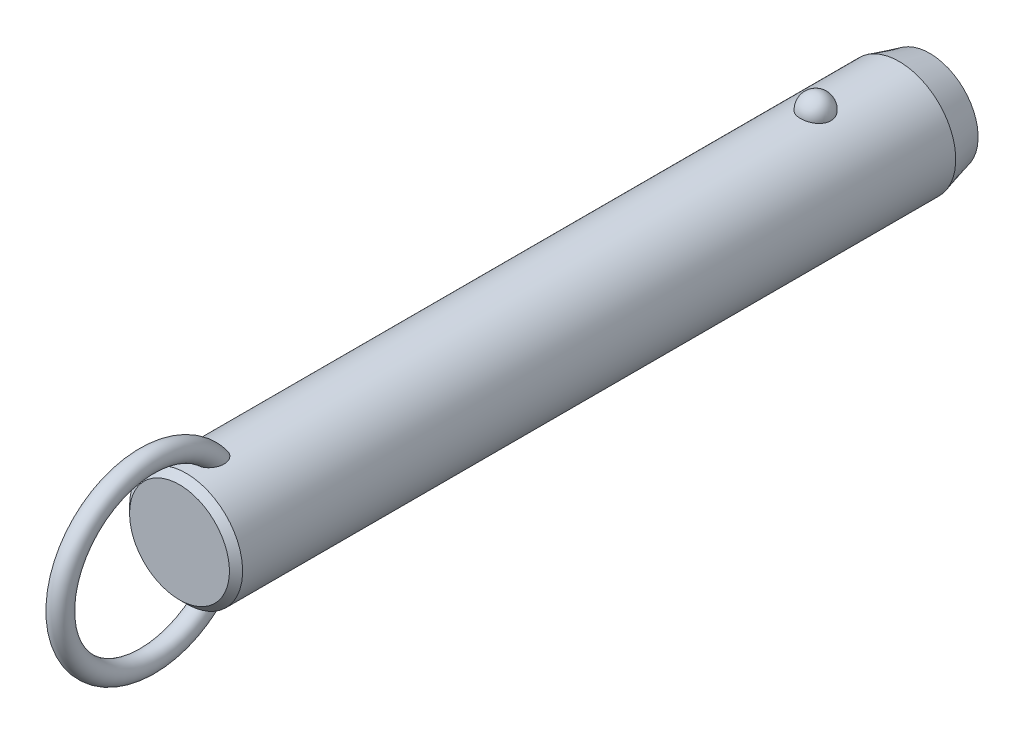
ISO-10303-21;
HEADER;
FILE_DESCRIPTION(('STEP AP214'),'2;1');
FILE_NAME('part.step','',(''),(''),'','','');
FILE_SCHEMA(('AUTOMOTIVE_DESIGN { 1 0 10303 214 1 1 1 1 }'));
ENDSEC;
DATA;
#1=APPLICATION_CONTEXT('core data for automotive mechanical design processes');
#2=APPLICATION_PROTOCOL_DEFINITION('international standard','automotive_design',2000,#1);
#3=PRODUCT_CONTEXT('',#1,'mechanical');
#4=PRODUCT('Part','Part','',(#3));
#5=PRODUCT_RELATED_PRODUCT_CATEGORY('part','',(#4));
#6=PRODUCT_DEFINITION_FORMATION('','',#4);
#7=PRODUCT_DEFINITION_CONTEXT('part definition',#1,'design');
#8=PRODUCT_DEFINITION('design','',#6,#7);
#9=PRODUCT_DEFINITION_SHAPE('','',#8);
#10=(LENGTH_UNIT() NAMED_UNIT(*) SI_UNIT(.MILLI.,.METRE.));
#11=(NAMED_UNIT(*) PLANE_ANGLE_UNIT() SI_UNIT($,.RADIAN.));
#12=(NAMED_UNIT(*) SI_UNIT($,.STERADIAN.) SOLID_ANGLE_UNIT());
#13=UNCERTAINTY_MEASURE_WITH_UNIT(LENGTH_MEASURE(1.E-05),#10,'distance_accuracy_value','');
#14=(GEOMETRIC_REPRESENTATION_CONTEXT(3) GLOBAL_UNCERTAINTY_ASSIGNED_CONTEXT((#13)) GLOBAL_UNIT_ASSIGNED_CONTEXT((#10,
#11,#12)) REPRESENTATION_CONTEXT('',''));
#15=CARTESIAN_POINT('',(0.,0.,0.));
#16=DIRECTION('',(0.,0.,1.));
#17=DIRECTION('',(1.,0.,0.));
#18=AXIS2_PLACEMENT_3D('',#15,#16,#17);
#19=CARTESIAN_POINT('',(0.,0.,109.2));
#20=DIRECTION('',(0.,0.,-1.));
#21=DIRECTION('',(-1.,0.,0.));
#22=AXIS2_PLACEMENT_3D('',#19,#20,#21);
#23=CYLINDRICAL_SURFACE('',#22,11.1);
#24=CARTESIAN_POINT('',(2.9724815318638,10.6945945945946,-3.));
#25=CARTESIAN_POINT('',(2.97247830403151,10.6945972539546,-2.83225059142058));
#26=CARTESIAN_POINT('',(2.95876598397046,10.6984356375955,-2.66445972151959));
#27=CARTESIAN_POINT('',(2.90424529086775,10.7133624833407,-2.33362381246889));
#28=CARTESIAN_POINT('',(2.8634252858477,10.7244540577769,-2.1705808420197));
#29=CARTESIAN_POINT('',(2.75573657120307,10.7526272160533,-1.85396767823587));
#30=CARTESIAN_POINT('',(2.68887937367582,10.7697061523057,-1.70039333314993));
#31=CARTESIAN_POINT('',(2.53079696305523,10.8079438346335,-1.40691598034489));
#32=CARTESIAN_POINT('',(2.43957264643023,10.8291024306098,-1.2670124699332));
#33=CARTESIAN_POINT('',(2.23458150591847,10.8732541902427,-1.00409565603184));
#34=CARTESIAN_POINT('',(2.12071295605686,10.8962553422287,-0.881162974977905));
#35=CARTESIAN_POINT('',(1.87365402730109,10.9414421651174,-0.656352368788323));
#36=CARTESIAN_POINT('',(1.74046358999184,10.9636278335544,-0.554474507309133));
#37=CARTESIAN_POINT('',(1.45872188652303,11.0046495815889,-0.374872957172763));
#38=CARTESIAN_POINT('',(1.31021276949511,11.0234944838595,-0.297085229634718));
#39=CARTESIAN_POINT('',(1.00170030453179,11.0557957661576,-0.167529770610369));
#40=CARTESIAN_POINT('',(0.841698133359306,11.0692526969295,-0.115759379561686));
#41=CARTESIAN_POINT('',(0.517607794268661,11.0890932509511,-0.0403925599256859));
#42=CARTESIAN_POINT('',(0.353633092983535,11.0955916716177,-0.0163383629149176));
#43=CARTESIAN_POINT('',(0.0238420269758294,11.1011989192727,0.0044517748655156));
#44=CARTESIAN_POINT('',(-0.141974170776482,11.1003084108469,0.00119017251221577));
#45=CARTESIAN_POINT('',(-0.468405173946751,11.0912990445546,-0.0323233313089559));
#46=CARTESIAN_POINT('',(-0.629059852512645,11.0832767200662,-0.0622147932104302));
#47=CARTESIAN_POINT('',(-0.942937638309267,11.0609962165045,-0.147645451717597));
#48=CARTESIAN_POINT('',(-1.09616062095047,11.0467379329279,-0.203185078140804));
#49=CARTESIAN_POINT('',(-1.39181061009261,11.0134071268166,-0.3387529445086));
#50=CARTESIAN_POINT('',(-1.53417383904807,10.9943086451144,-0.418913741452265));
#51=CARTESIAN_POINT('',(-1.80342160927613,10.9533667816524,-0.60144882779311));
#52=CARTESIAN_POINT('',(-1.9303046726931,10.9315231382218,-0.703825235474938));
#53=CARTESIAN_POINT('',(-2.16747598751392,10.887005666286,-0.930091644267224));
#54=CARTESIAN_POINT('',(-2.27742774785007,10.8643239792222,-1.05433291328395));
#55=CARTESIAN_POINT('',(-2.47517316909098,10.8209886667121,-1.31966633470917));
#56=CARTESIAN_POINT('',(-2.56296538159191,10.8003351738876,-1.46075958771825));
#57=CARTESIAN_POINT('',(-2.71500300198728,10.7631304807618,-1.75753646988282));
#58=CARTESIAN_POINT('',(-2.77898901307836,10.7466250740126,-1.91335887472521));
#59=CARTESIAN_POINT('',(-2.88046189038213,10.7198747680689,-2.2339152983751));
#60=CARTESIAN_POINT('',(-2.91794947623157,10.709629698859,-2.39864907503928));
#61=CARTESIAN_POINT('',(-2.96537819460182,10.6965949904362,-2.73165170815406));
#62=CARTESIAN_POINT('',(-2.97542891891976,10.693775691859,-2.89990378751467));
#63=CARTESIAN_POINT('',(-2.96804271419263,10.6958279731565,-3.235752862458));
#64=CARTESIAN_POINT('',(-2.95060646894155,10.7006993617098,-3.40334987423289));
#65=CARTESIAN_POINT('',(-2.88883358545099,10.71753912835,-3.73233906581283));
#66=CARTESIAN_POINT('',(-2.84462026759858,10.7294749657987,-3.89375610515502));
#67=CARTESIAN_POINT('',(-2.73050447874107,10.7590797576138,-4.20667949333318));
#68=CARTESIAN_POINT('',(-2.66060103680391,10.7767489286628,-4.35818546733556));
#69=CARTESIAN_POINT('',(-2.49642559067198,10.8159599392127,-4.6478542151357));
#70=CARTESIAN_POINT('',(-2.40203047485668,10.8375211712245,-4.78594458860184));
#71=CARTESIAN_POINT('',(-2.19143488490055,10.8820570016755,-5.0441038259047));
#72=CARTESIAN_POINT('',(-2.07523364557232,10.9050316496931,-5.16417205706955));
#73=CARTESIAN_POINT('',(-1.82361254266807,10.9499219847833,-5.38334833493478));
#74=CARTESIAN_POINT('',(-1.68812945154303,10.9718338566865,-5.48238464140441));
#75=CARTESIAN_POINT('',(-1.40191298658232,11.0120611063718,-5.65618873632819));
#76=CARTESIAN_POINT('',(-1.25118062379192,11.0303767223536,-5.73095813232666));
#77=CARTESIAN_POINT('',(-0.940570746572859,11.0611653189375,-5.85334725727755));
#78=CARTESIAN_POINT('',(-0.780821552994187,11.0737044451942,-5.90127578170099));
#79=CARTESIAN_POINT('',(-0.455204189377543,11.0918598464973,-5.96992976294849));
#80=CARTESIAN_POINT('',(-0.289336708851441,11.0974768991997,-5.99065827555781));
#81=CARTESIAN_POINT('',(0.0406846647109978,11.1011307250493,-6.00418773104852));
#82=CARTESIAN_POINT('',(0.204817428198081,11.099299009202,-5.99747318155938));
#83=CARTESIAN_POINT('',(0.5295530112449,11.088551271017,-5.9574031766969));
#84=CARTESIAN_POINT('',(0.69015594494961,11.0796354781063,-5.92404858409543));
#85=CARTESIAN_POINT('',(1.0027760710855,11.0557204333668,-5.83180084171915));
#86=CARTESIAN_POINT('',(1.15482001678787,11.0407414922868,-5.77299291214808));
#87=CARTESIAN_POINT('',(1.44678373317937,11.0062913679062,-5.63147366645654));
#88=CARTESIAN_POINT('',(1.58670279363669,10.9868199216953,-5.54876095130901));
#89=CARTESIAN_POINT('',(1.8527023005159,10.9451315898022,-5.36027644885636));
#90=CARTESIAN_POINT('',(1.97855158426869,10.9228788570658,-5.25418644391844));
#91=CARTESIAN_POINT('',(2.21080872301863,10.8782509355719,-5.02251354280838));
#92=CARTESIAN_POINT('',(2.31721312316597,10.8558757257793,-4.89692718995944));
#93=CARTESIAN_POINT('',(2.5094551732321,10.8130715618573,-4.62745408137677));
#94=CARTESIAN_POINT('',(2.59493284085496,10.7926798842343,-4.48330448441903));
#95=CARTESIAN_POINT('',(2.740862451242,10.7565495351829,-4.18236358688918));
#96=CARTESIAN_POINT('',(2.80132490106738,10.7408089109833,-4.02557762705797));
#97=CARTESIAN_POINT('',(2.88959070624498,10.7173718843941,-3.72475308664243));
#98=CARTESIAN_POINT('',(2.92062102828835,10.7088950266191,-3.58171216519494));
#99=CARTESIAN_POINT('',(2.96206765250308,10.6975052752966,-3.29245795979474));
#100=CARTESIAN_POINT('',(2.97248434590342,10.6945922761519,-3.14624473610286));
#101=CARTESIAN_POINT('',(2.9724815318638,10.6945945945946,-3.));
#102=B_SPLINE_CURVE_WITH_KNOTS('',3,(#24,#25,#26,#27,#28,#29,#30,#31,#32,#33,#34,#35,#36,#37,
#38,#39,#40,#41,#42,#43,#44,#45,#46,#47,#48,#49,#50,#51,#52,#53,#54,#55,#56,#57,#58,#59,#60,#61,
#62,#63,#64,#65,#66,#67,#68,#69,#70,#71,#72,#73,#74,#75,#76,#77,#78,#79,#80,#81,#82,#83,#84,#85,
#86,#87,#88,#89,#90,#91,#92,#93,#94,#95,#96,#97,#98,#99,#100,#101),.UNSPECIFIED.,.T.,.F.,(4,2,2,
2,2,2,2,2,2,2,2,2,2,2,2,2,2,2,2,2,2,2,2,2,2,2,2,2,2,2,2,2,2,2,2,2,2,2,4),(0.,0.502722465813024,
1.00566079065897,1.5083769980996,2.01107471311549,2.51608392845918,3.02109467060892,
3.52475118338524,4.02835620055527,4.523518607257,5.0186364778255,5.50715297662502,
5.9956776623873,6.48688002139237,6.97812923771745,7.47814366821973,7.9781907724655,
8.48353712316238,8.9888697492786,9.49218093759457,9.99547960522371,10.4964777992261,
10.997494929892,11.5010810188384,12.0046847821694,12.5099796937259,13.0152411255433,
13.5145635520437,14.0138298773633,14.5043200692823,14.9947943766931,15.4836390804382,
15.9725123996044,16.4685040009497,16.9645836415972,17.4686765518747,17.972557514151,
18.410841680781,18.849117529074),.UNSPECIFIED.);
#103=CARTESIAN_POINT('',(2.9724815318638,10.6945945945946,-3.));
#104=VERTEX_POINT('',#103);
#105=EDGE_CURVE('E41',#104,#104,#102,.T.);
#106=ORIENTED_EDGE('',*,*,#105,.T.);
#107=EDGE_LOOP('',(#106));
#108=FACE_BOUND('',#107,.T.);
#109=CARTESIAN_POINT('',(0.,0.,120.6));
#110=DIRECTION('',(0.,0.,1.));
#111=DIRECTION('',(1.,0.,0.));
#112=AXIS2_PLACEMENT_3D('',#109,#110,#111);
#113=CIRCLE('',#112,11.1);
#114=CARTESIAN_POINT('',(-11.1,0.,120.6));
#115=VERTEX_POINT('',#114);
#116=EDGE_CURVE('E10',#115,#115,#113,.F.);
#117=ORIENTED_EDGE('',*,*,#116,.T.);
#118=EDGE_LOOP('',(#117));
#119=FACE_BOUND('',#118,.T.);
#120=CARTESIAN_POINT('',(-0.564520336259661,-11.0856356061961,112.857815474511));
#121=CARTESIAN_POINT('',(-0.667202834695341,-11.0804062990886,112.891283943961));
#122=CARTESIAN_POINT('',(-0.766875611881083,-11.0738877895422,112.933835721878));
#123=CARTESIAN_POINT('',(-0.957284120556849,-11.0590576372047,113.035419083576));
#124=CARTESIAN_POINT('',(-1.04801616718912,-11.0507452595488,113.09445742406));
#125=CARTESIAN_POINT('',(-1.21800952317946,-11.0333016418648,113.226529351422));
#126=CARTESIAN_POINT('',(-1.29730805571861,-11.0241732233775,113.299515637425));
#127=CARTESIAN_POINT('',(-1.44337665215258,-11.0060026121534,113.457037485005));
#128=CARTESIAN_POINT('',(-1.51014622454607,-10.9969604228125,113.541573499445));
#129=CARTESIAN_POINT('',(-1.63454620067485,-10.9791841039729,113.725521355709));
#130=CARTESIAN_POINT('',(-1.69127003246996,-10.9705107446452,113.825549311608));
#131=CARTESIAN_POINT('',(-1.78980785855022,-10.9548648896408,114.032790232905));
#132=CARTESIAN_POINT('',(-1.83161214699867,-10.9478935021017,114.140007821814));
#133=CARTESIAN_POINT('',(-1.91557028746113,-10.9335803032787,114.405408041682));
#134=CARTESIAN_POINT('',(-1.95040620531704,-10.9273269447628,114.565980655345));
#135=CARTESIAN_POINT('',(-1.99388326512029,-10.9194709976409,114.890697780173));
#136=CARTESIAN_POINT('',(-2.00248051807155,-10.9178762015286,115.054847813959));
#137=CARTESIAN_POINT('',(-1.99551615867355,-10.9191578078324,115.424650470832));
#138=CARTESIAN_POINT('',(-1.9732206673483,-10.9232807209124,115.630191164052));
#139=CARTESIAN_POINT('',(-1.9152976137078,-10.9335244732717,115.933595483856));
#140=CARTESIAN_POINT('',(-1.8918457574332,-10.9376266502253,116.034088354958));
#141=CARTESIAN_POINT('',(-1.83700674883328,-10.9469720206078,116.232855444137));
#142=CARTESIAN_POINT('',(-1.80562070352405,-10.9522150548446,116.331129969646));
#143=CARTESIAN_POINT('',(-1.73463055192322,-10.9636837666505,116.525914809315));
#144=CARTESIAN_POINT('',(-1.6949341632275,-10.9699202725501,116.622390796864));
#145=CARTESIAN_POINT('',(-1.60745141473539,-10.9830806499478,116.811626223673));
#146=CARTESIAN_POINT('',(-1.55966150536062,-10.9900048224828,116.904384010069));
#147=CARTESIAN_POINT('',(-1.45591812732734,-11.0042280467,117.084690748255));
#148=CARTESIAN_POINT('',(-1.40000013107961,-11.0115253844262,117.172260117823));
#149=CARTESIAN_POINT('',(-1.2793747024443,-11.0261911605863,117.341029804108));
#150=CARTESIAN_POINT('',(-1.2146783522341,-11.0335594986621,117.42223795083));
#151=CARTESIAN_POINT('',(-1.08218150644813,-11.0473027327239,117.569001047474));
#152=CARTESIAN_POINT('',(-1.0152263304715,-11.0537063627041,117.635309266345));
#153=CARTESIAN_POINT('',(-0.872952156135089,-11.065850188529,117.758378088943));
#154=CARTESIAN_POINT('',(-0.797642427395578,-11.0715911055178,117.815149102));
#155=CARTESIAN_POINT('',(-0.651396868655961,-11.081071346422,117.907515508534));
#156=CARTESIAN_POINT('',(-0.581712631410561,-11.0849841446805,117.945049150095));
#157=CARTESIAN_POINT('',(-0.437066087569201,-11.0916271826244,118.008259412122));
#158=CARTESIAN_POINT('',(-0.362109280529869,-11.0943586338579,118.033948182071));
#159=CARTESIAN_POINT('',(-0.207828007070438,-11.0983242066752,118.071117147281));
#160=CARTESIAN_POINT('',(-0.128467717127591,-11.0995432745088,118.082454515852));
#161=CARTESIAN_POINT('',(0.0309101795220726,-11.1002423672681,118.088965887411));
#162=CARTESIAN_POINT('',(0.110927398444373,-11.0997233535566,118.084148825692));
#163=CARTESIAN_POINT('',(0.256406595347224,-11.097240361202,118.060959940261));
#164=CARTESIAN_POINT('',(0.322235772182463,-11.0955074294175,118.044754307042));
#165=CARTESIAN_POINT('',(0.450635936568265,-11.0910350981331,118.002600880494));
#166=CARTESIAN_POINT('',(0.513205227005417,-11.0882951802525,117.976648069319));
#167=CARTESIAN_POINT('',(0.6626263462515,-11.0805620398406,117.902607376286));
#168=CARTESIAN_POINT('',(0.74712753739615,-11.0751144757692,117.849845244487));
#169=CARTESIAN_POINT('',(0.906756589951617,-11.0631932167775,117.731720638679));
#170=CARTESIAN_POINT('',(0.981859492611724,-11.0567168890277,117.666325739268));
#171=CARTESIAN_POINT('',(1.10712207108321,-11.0447856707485,117.54226337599));
#172=CARTESIAN_POINT('',(1.15909566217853,-11.0394280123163,117.485383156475));
#173=CARTESIAN_POINT('',(1.25791923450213,-11.0286040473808,117.367327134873));
#174=CARTESIAN_POINT('',(1.30476642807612,-11.0231376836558,117.306149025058));
#175=CARTESIAN_POINT('',(1.43818612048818,-11.0068027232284,117.117305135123));
#176=CARTESIAN_POINT('',(1.51751767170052,-10.9960104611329,116.984453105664));
#177=CARTESIAN_POINT('',(1.63597546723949,-10.9788847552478,116.753137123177));
#178=CARTESIAN_POINT('',(1.67988876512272,-10.9722190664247,116.657053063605));
#179=CARTESIAN_POINT('',(1.75953241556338,-10.9597298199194,116.461431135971));
#180=CARTESIAN_POINT('',(1.79525967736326,-10.9539065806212,116.361891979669));
#181=CARTESIAN_POINT('',(1.85844731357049,-10.9433632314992,116.16021118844));
#182=CARTESIAN_POINT('',(1.88591073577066,-10.9386427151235,116.058070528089));
#183=CARTESIAN_POINT('',(1.93234324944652,-10.9305350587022,115.851819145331));
#184=CARTESIAN_POINT('',(1.95131065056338,-10.9271481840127,115.747708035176));
#185=CARTESIAN_POINT('',(1.99040203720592,-10.9201183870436,115.465458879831));
#186=CARTESIAN_POINT('',(2.00221217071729,-10.9179256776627,115.286037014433));
#187=CARTESIAN_POINT('',(1.99711676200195,-10.9188636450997,114.927713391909));
#188=CARTESIAN_POINT('',(1.98026150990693,-10.9219849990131,114.748811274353));
#189=CARTESIAN_POINT('',(1.92151657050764,-10.9324473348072,114.43645144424));
#190=CARTESIAN_POINT('',(1.88605081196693,-10.9386915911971,114.301759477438));
#191=CARTESIAN_POINT('',(1.79393020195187,-10.9541780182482,114.039966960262));
#192=CARTESIAN_POINT('',(1.73729868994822,-10.9634168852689,113.912858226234));
#193=CARTESIAN_POINT('',(1.61237037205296,-10.9824218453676,113.689418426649));
#194=CARTESIAN_POINT('',(1.54715374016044,-10.9918945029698,113.591345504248));
#195=CARTESIAN_POINT('',(1.40127026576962,-11.0114415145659,113.407434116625));
#196=CARTESIAN_POINT('',(1.3206074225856,-11.0215157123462,113.321592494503));
#197=CARTESIAN_POINT('',(1.14474787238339,-11.041168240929,113.165163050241));
#198=CARTESIAN_POINT('',(1.04947805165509,-11.0507437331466,113.094656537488));
#199=CARTESIAN_POINT('',(0.847278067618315,-11.0680789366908,112.972640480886));
#200=CARTESIAN_POINT('',(0.740351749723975,-11.0758392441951,112.921124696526));
#201=CARTESIAN_POINT('',(0.529289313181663,-11.0878275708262,112.843485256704));
#202=CARTESIAN_POINT('',(0.425895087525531,-11.0923259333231,112.815377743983));
#203=CARTESIAN_POINT('',(0.215723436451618,-11.0984001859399,112.777703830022));
#204=CARTESIAN_POINT('',(0.108947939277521,-11.0999777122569,112.768127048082));
#205=CARTESIAN_POINT('',(-0.0938962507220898,-11.1000196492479,112.767877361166));
#206=CARTESIAN_POINT('',(-0.189967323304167,-11.0987797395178,112.775408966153));
#207=CARTESIAN_POINT('',(-0.379657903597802,-11.0939111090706,112.805507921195));
#208=CARTESIAN_POINT('',(-0.473277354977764,-11.0902823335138,112.828075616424));
#209=CARTESIAN_POINT('',(-0.564520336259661,-11.0856356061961,112.857815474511));
#210=B_SPLINE_CURVE_WITH_KNOTS('',3,(#120,#121,#122,#123,#124,#125,#126,#127,#128,#129,#130,
#131,#132,#133,#134,#135,#136,#137,#138,#139,#140,#141,#142,#143,#144,#145,#146,#147,#148,#149,
#150,#151,#152,#153,#154,#155,#156,#157,#158,#159,#160,#161,#162,#163,#164,#165,#166,#167,#168,
#169,#170,#171,#172,#173,#174,#175,#176,#177,#178,#179,#180,#181,#182,#183,#184,#185,#186,#187,
#188,#189,#190,#191,#192,#193,#194,#195,#196,#197,#198,#199,#200,#201,#202,#203,#204,#205,#206,
#207,#208,#209),.UNSPECIFIED.,.T.,.F.,(4,2,2,2,2,2,2,2,2,2,2,2,2,2,2,2,2,2,2,2,2,2,2,2,2,2,2,2,
2,2,2,2,2,2,2,2,2,2,2,2,2,2,2,2,4),(0.,0.323999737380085,0.648132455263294,0.971184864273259,
1.2942499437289,1.6388623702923,1.98369857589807,2.47426059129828,2.96564271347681,
3.58257396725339,3.89215258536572,4.201688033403,4.51486273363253,4.82817514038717,
5.14015911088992,5.45175282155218,5.73442856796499,6.01679375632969,6.25364580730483,
6.49025437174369,6.72919963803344,6.96801276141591,7.17061258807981,7.37331685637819,
7.67094989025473,7.9693572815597,8.20075067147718,8.43226927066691,8.89581623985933,
9.21306533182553,9.5304340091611,9.84768549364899,10.1650000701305,10.7022930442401,
11.2386443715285,11.6553390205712,12.0715755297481,12.4245637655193,12.7774607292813,
13.1321855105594,13.4867936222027,13.8068771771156,14.1267813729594,14.4146787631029,
14.7025827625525),.UNSPECIFIED.);
#211=CARTESIAN_POINT('',(-0.564520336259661,-11.0856356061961,112.857815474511));
#212=VERTEX_POINT('',#211);
#213=EDGE_CURVE('E59',#212,#212,#210,.T.);
#214=ORIENTED_EDGE('',*,*,#213,.T.);
#215=EDGE_LOOP('',(#214));
#216=FACE_BOUND('',#215,.T.);
#217=CARTESIAN_POINT('',(-0.564520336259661,11.0856356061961,112.857815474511));
#218=CARTESIAN_POINT('',(-0.468542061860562,11.0905203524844,112.826545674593));
#219=CARTESIAN_POINT('',(-0.36979381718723,11.0942886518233,112.803157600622));
#220=CARTESIAN_POINT('',(-0.169555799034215,11.0991586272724,112.773085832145));
#221=CARTESIAN_POINT('',(-0.0680604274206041,11.1002543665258,112.76643932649));
#222=CARTESIAN_POINT('',(0.134549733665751,11.099646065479,112.770157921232));
#223=CARTESIAN_POINT('',(0.235664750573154,11.0979441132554,112.78051033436));
#224=CARTESIAN_POINT('',(0.434632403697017,11.0919342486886,112.817831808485));
#225=CARTESIAN_POINT('',(0.532486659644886,11.0876276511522,112.844792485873));
#226=CARTESIAN_POINT('',(0.722445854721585,11.0768742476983,112.9144096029));
#227=CARTESIAN_POINT('',(0.814543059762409,11.0704246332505,112.957086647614));
#228=CARTESIAN_POINT('',(0.99056508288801,11.0560659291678,113.056648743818));
#229=CARTESIAN_POINT('',(1.07448844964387,11.048156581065,113.113536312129));
#230=CARTESIAN_POINT('',(1.23562672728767,11.0313221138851,113.242210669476));
#231=CARTESIAN_POINT('',(1.3124268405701,11.0223686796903,113.314511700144));
#232=CARTESIAN_POINT('',(1.45398030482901,11.0045918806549,113.470042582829));
#233=CARTESIAN_POINT('',(1.5187307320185,10.9957685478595,113.553275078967));
#234=CARTESIAN_POINT('',(1.64107232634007,10.9782087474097,113.736384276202));
#235=CARTESIAN_POINT('',(1.69743176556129,10.9695572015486,113.837089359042));
#236=CARTESIAN_POINT('',(1.79515063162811,10.9539887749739,114.045626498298));
#237=CARTESIAN_POINT('',(1.83649966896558,10.9470730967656,114.15346343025));
#238=CARTESIAN_POINT('',(1.91931148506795,10.9329211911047,114.420399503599));
#239=CARTESIAN_POINT('',(1.95340104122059,10.9267904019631,114.581861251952));
#240=CARTESIAN_POINT('',(1.99526195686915,10.9192174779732,114.90821631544));
#241=CARTESIAN_POINT('',(2.00298989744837,10.9177830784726,115.07311484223));
#242=CARTESIAN_POINT('',(1.9939625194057,10.9194420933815,115.444100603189));
#243=CARTESIAN_POINT('',(1.97050829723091,10.923774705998,115.65003871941));
#244=CARTESIAN_POINT('',(1.91079643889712,10.9343131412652,115.953901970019));
#245=CARTESIAN_POINT('',(1.88673702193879,10.9385106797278,116.054529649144));
#246=CARTESIAN_POINT('',(1.83065508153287,10.9480376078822,116.253510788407));
#247=CARTESIAN_POINT('',(1.79863369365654,10.9533668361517,116.351864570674));
#248=CARTESIAN_POINT('',(1.72633365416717,10.9649954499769,116.546720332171));
#249=CARTESIAN_POINT('',(1.68596409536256,10.9713053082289,116.64318790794));
#250=CARTESIAN_POINT('',(1.5970799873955,10.9845964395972,116.832323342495));
#251=CARTESIAN_POINT('',(1.54856169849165,10.9915780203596,116.924989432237));
#252=CARTESIAN_POINT('',(1.44330168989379,11.0058935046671,117.104975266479));
#253=CARTESIAN_POINT('',(1.38659749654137,11.0132257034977,117.192316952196));
#254=CARTESIAN_POINT('',(1.26431158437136,11.0279330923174,117.360456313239));
#255=CARTESIAN_POINT('',(1.19874160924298,11.0353082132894,117.441262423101));
#256=CARTESIAN_POINT('',(1.06542088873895,11.048931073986,117.585985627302));
#257=CARTESIAN_POINT('',(0.998640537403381,11.0552153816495,117.650784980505));
#258=CARTESIAN_POINT('',(0.856896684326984,11.0671032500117,117.770846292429));
#259=CARTESIAN_POINT('',(0.781942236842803,11.0727075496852,117.826118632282));
#260=CARTESIAN_POINT('',(0.636276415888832,11.081949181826,117.915972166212));
#261=CARTESIAN_POINT('',(0.566755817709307,11.0857572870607,117.952441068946));
#262=CARTESIAN_POINT('',(0.422602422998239,11.0921860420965,118.013533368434));
#263=CARTESIAN_POINT('',(0.347974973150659,11.0948079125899,118.038168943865));
#264=CARTESIAN_POINT('',(0.19459385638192,11.0985608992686,118.073323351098));
#265=CARTESIAN_POINT('',(0.115807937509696,11.0996777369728,118.083706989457));
#266=CARTESIAN_POINT('',(-0.0422499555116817,11.1002003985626,118.088574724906));
#267=CARTESIAN_POINT('',(-0.121521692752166,11.09960699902,118.083066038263));
#268=CARTESIAN_POINT('',(-0.266046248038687,11.0970123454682,118.058827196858));
#269=CARTESIAN_POINT('',(-0.331661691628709,11.0952283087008,118.042135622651));
#270=CARTESIAN_POINT('',(-0.459588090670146,11.0906663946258,117.999111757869));
#271=CARTESIAN_POINT('',(-0.521897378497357,11.0878880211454,117.972774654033));
#272=CARTESIAN_POINT('',(-0.6714464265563,11.0800342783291,117.897513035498));
#273=CARTESIAN_POINT('',(-0.756250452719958,11.0744969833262,117.843818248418));
#274=CARTESIAN_POINT('',(-0.916349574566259,11.0624045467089,117.723802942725));
#275=CARTESIAN_POINT('',(-0.991618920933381,11.0558467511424,117.657449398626));
#276=CARTESIAN_POINT('',(-1.11713140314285,11.0437783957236,117.531633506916));
#277=CARTESIAN_POINT('',(-1.16920539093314,11.0383619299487,117.473952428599));
#278=CARTESIAN_POINT('',(-1.26817476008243,11.02743010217,117.354280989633));
#279=CARTESIAN_POINT('',(-1.31506731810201,11.0219146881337,117.292288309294));
#280=CARTESIAN_POINT('',(-1.40399813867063,11.0109399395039,117.164784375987));
#281=CARTESIAN_POINT('',(-1.4460286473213,11.0054807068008,117.099267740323));
#282=CARTESIAN_POINT('',(-1.52538779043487,10.9947621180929,116.965422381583));
#283=CARTESIAN_POINT('',(-1.56271516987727,10.9895028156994,116.897092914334));
#284=CARTESIAN_POINT('',(-1.64537943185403,10.9774790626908,116.733210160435));
#285=CARTESIAN_POINT('',(-1.68879497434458,10.9708503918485,116.6366735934));
#286=CARTESIAN_POINT('',(-1.76740738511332,10.9584602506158,116.440236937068));
#287=CARTESIAN_POINT('',(-1.80260120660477,10.95269910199,116.34033561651));
#288=CARTESIAN_POINT('',(-1.86468657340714,10.9423003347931,116.137966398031));
#289=CARTESIAN_POINT('',(-1.89158164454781,10.9376622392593,116.035499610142));
#290=CARTESIAN_POINT('',(-1.93682458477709,10.9297405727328,115.828642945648));
#291=CARTESIAN_POINT('',(-1.9551708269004,10.9264572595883,115.724252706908));
#292=CARTESIAN_POINT('',(-1.99232562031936,10.9197647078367,115.44262876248));
#293=CARTESIAN_POINT('',(-2.00294603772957,10.9177914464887,115.264185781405));
#294=CARTESIAN_POINT('',(-1.99566675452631,10.9191290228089,114.907996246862));
#295=CARTESIAN_POINT('',(-1.97781651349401,10.9224306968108,114.73024902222));
#296=CARTESIAN_POINT('',(-1.91747214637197,10.93315926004,114.419792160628));
#297=CARTESIAN_POINT('',(-1.88131022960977,10.9395108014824,114.285825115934));
#298=CARTESIAN_POINT('',(-1.7879038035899,10.9551659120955,114.02559757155));
#299=CARTESIAN_POINT('',(-1.73068309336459,10.9644661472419,113.899328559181));
#300=CARTESIAN_POINT('',(-1.60475573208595,10.9835398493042,113.67741565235));
#301=CARTESIAN_POINT('',(-1.53908879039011,10.9930297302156,113.580026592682));
#302=CARTESIAN_POINT('',(-1.39238608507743,11.0125708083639,113.397525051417));
#303=CARTESIAN_POINT('',(-1.31135150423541,11.0226219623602,113.312411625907));
#304=CARTESIAN_POINT('',(-1.14382035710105,11.0411991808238,113.16529943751));
#305=CARTESIAN_POINT('',(-1.05858500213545,11.0497792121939,113.10186930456));
#306=CARTESIAN_POINT('',(-0.878723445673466,11.0655285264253,112.990250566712));
#307=CARTESIAN_POINT('',(-0.784123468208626,11.0727015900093,112.942020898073));
#308=CARTESIAN_POINT('',(-0.646163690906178,11.0812501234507,112.886023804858));
#309=CARTESIAN_POINT('',(-0.605595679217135,11.0835451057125,112.871197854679));
#310=CARTESIAN_POINT('',(-0.564520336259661,11.0856356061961,112.857815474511));
#311=B_SPLINE_CURVE_WITH_KNOTS('',3,(#217,#218,#219,#220,#221,#222,#223,#224,#225,#226,#227,
#228,#229,#230,#231,#232,#233,#234,#235,#236,#237,#238,#239,#240,#241,#242,#243,#244,#245,#246,
#247,#248,#249,#250,#251,#252,#253,#254,#255,#256,#257,#258,#259,#260,#261,#262,#263,#264,#265,
#266,#267,#268,#269,#270,#271,#272,#273,#274,#275,#276,#277,#278,#279,#280,#281,#282,#283,#284,
#285,#286,#287,#288,#289,#290,#291,#292,#293,#294,#295,#296,#297,#298,#299,#300,#301,#302,#303,
#304,#305,#306,#307,#308,#309,#310),.UNSPECIFIED.,.T.,.F.,(4,2,2,2,2,2,2,2,2,2,2,2,2,2,2,2,2,2,
2,2,2,2,2,2,2,2,2,2,2,2,2,2,2,2,2,2,2,2,2,2,2,2,2,2,2,2,4),(0.,0.303061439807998,
0.606795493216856,0.910302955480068,1.21365733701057,1.51741085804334,1.82121821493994,
2.13745205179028,2.45376252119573,2.79958678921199,3.14564996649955,3.6383239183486,
4.13180893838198,4.75031912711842,5.06071926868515,5.37107516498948,5.68500772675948,
5.99908475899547,6.31176519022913,6.62403542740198,6.90315673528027,7.1819719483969,
7.41687778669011,7.65154134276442,7.88841587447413,8.12518286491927,8.32752842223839,
8.52997509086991,8.82986421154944,9.13054668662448,9.36393502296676,9.59744991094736,
9.83133221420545,10.0652767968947,10.383032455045,10.7009056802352,11.0186436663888,
11.3364420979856,11.8705925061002,12.4038159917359,12.8189662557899,13.2336487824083,
13.5857049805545,13.9377340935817,14.2561354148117,14.5736690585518,14.7033687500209),.UNSPECIFIED.);
#312=CARTESIAN_POINT('',(-0.564520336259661,11.0856356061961,112.857815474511));
#313=VERTEX_POINT('',#312);
#314=EDGE_CURVE('E67',#313,#313,#311,.T.);
#315=ORIENTED_EDGE('',*,*,#314,.T.);
#316=EDGE_LOOP('',(#315));
#317=FACE_BOUND('',#316,.T.);
#318=CARTESIAN_POINT('',(0.,0.,-19.3999999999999));
#319=DIRECTION('',(0.,0.,-1.));
#320=DIRECTION('',(-1.,0.,0.));
#321=AXIS2_PLACEMENT_3D('',#318,#319,#320);
#322=CIRCLE('',#321,11.1);
#323=CARTESIAN_POINT('',(-11.1,0.,-19.3999999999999));
#324=VERTEX_POINT('',#323);
#325=EDGE_CURVE('E56',#324,#324,#322,.F.);
#326=ORIENTED_EDGE('',*,*,#325,.T.);
#327=EDGE_LOOP('',(#326));
#328=FACE_BOUND('',#327,.T.);
#329=ADVANCED_FACE('F37',(#108,#119,#216,#317,#328),#23,.T.);
#330=CARTESIAN_POINT('',(0.,0.,-25.4));
#331=DIRECTION('',(0.,0.,-1.));
#332=DIRECTION('',(-1.,0.,0.));
#333=AXIS2_PLACEMENT_3D('',#330,#331,#332);
#334=PLANE('',#333);
#335=CARTESIAN_POINT('',(0.,0.,-25.4));
#336=DIRECTION('',(0.,0.,-1.));
#337=DIRECTION('',(-1.,0.,0.));
#338=AXIS2_PLACEMENT_3D('',#335,#336,#337);
#339=CIRCLE('',#338,9.49230484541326);
#340=CARTESIAN_POINT('',(-9.49230484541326,0.,-25.4));
#341=VERTEX_POINT('',#340);
#342=EDGE_CURVE('E66',#341,#341,#339,.T.);
#343=ORIENTED_EDGE('',*,*,#342,.T.);
#344=EDGE_LOOP('',(#343));
#345=FACE_BOUND('',#344,.T.);
#346=ADVANCED_FACE('F85',(#345),#334,.T.);
#347=CARTESIAN_POINT('',(0.,0.,-25.4));
#348=DIRECTION('',(0.,0.,1.));
#349=DIRECTION('',(1.,0.,0.));
#350=AXIS2_PLACEMENT_3D('',#347,#348,#349);
#351=CONICAL_SURFACE('',#350,9.49230484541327,0.261799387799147);
#352=ORIENTED_EDGE('',*,*,#325,.F.);
#353=EDGE_LOOP('',(#352));
#354=FACE_BOUND('',#353,.T.);
#355=ORIENTED_EDGE('',*,*,#342,.F.);
#356=EDGE_LOOP('',(#355));
#357=FACE_BOUND('',#356,.T.);
#358=ADVANCED_FACE('F83',(#354,#357),#351,.T.);
#359=CARTESIAN_POINT('',(0.,0.,121.9));
#360=DIRECTION('',(0.,0.,1.));
#361=DIRECTION('',(1.,0.,0.));
#362=AXIS2_PLACEMENT_3D('',#359,#360,#361);
#363=PLANE('',#362);
#364=CARTESIAN_POINT('',(0.,0.,121.9));
#365=DIRECTION('',(0.,0.,1.));
#366=DIRECTION('',(1.,0.,0.));
#367=AXIS2_PLACEMENT_3D('',#364,#365,#366);
#368=CIRCLE('',#367,9.79999999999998);
#369=CARTESIAN_POINT('',(-9.79999999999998,0.,121.9));
#370=VERTEX_POINT('',#369);
#371=EDGE_CURVE('E50',#370,#370,#368,.T.);
#372=ORIENTED_EDGE('',*,*,#371,.T.);
#373=EDGE_LOOP('',(#372));
#374=FACE_BOUND('',#373,.T.);
#375=ADVANCED_FACE('F77',(#374),#363,.T.);
#376=CARTESIAN_POINT('',(0.,0.,128.25));
#377=DIRECTION('',(1.,0.,0.));
#378=DIRECTION('',(0.,0.,-1.));
#379=AXIS2_PLACEMENT_3D('',#376,#377,#378);
#380=TOROIDAL_SURFACE('',#379,17.05,2.);
#381=ORIENTED_EDGE('',*,*,#314,.F.);
#382=EDGE_LOOP('',(#381));
#383=FACE_BOUND('',#382,.T.);
#384=ORIENTED_EDGE('',*,*,#213,.F.);
#385=EDGE_LOOP('',(#384));
#386=FACE_BOUND('',#385,.T.);
#387=ADVANCED_FACE('F73',(#383,#386),#380,.T.);
#388=CARTESIAN_POINT('',(0.,0.,121.9));
#389=DIRECTION('',(0.,0.,-1.));
#390=DIRECTION('',(-1.,0.,0.));
#391=AXIS2_PLACEMENT_3D('',#388,#389,#390);
#392=CONICAL_SURFACE('',#391,9.79999999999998,0.785398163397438);
#393=CARTESIAN_POINT('',(-11.1,0.,120.6));
#394=CARTESIAN_POINT('',(-11.0864583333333,0.,120.613541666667));
#395=CARTESIAN_POINT('',(-11.0729166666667,0.,120.627083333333));
#396=CARTESIAN_POINT('',(-11.0458333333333,0.,120.654166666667));
#397=CARTESIAN_POINT('',(-11.0322916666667,0.,120.667708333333));
#398=CARTESIAN_POINT('',(-11.0052083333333,0.,120.694791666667));
#399=CARTESIAN_POINT('',(-10.9916666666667,0.,120.708333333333));
#400=CARTESIAN_POINT('',(-10.9645833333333,0.,120.735416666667));
#401=CARTESIAN_POINT('',(-10.9510416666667,0.,120.748958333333));
#402=CARTESIAN_POINT('',(-10.9239583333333,0.,120.776041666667));
#403=CARTESIAN_POINT('',(-10.9104166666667,0.,120.789583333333));
#404=CARTESIAN_POINT('',(-10.8833333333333,0.,120.816666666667));
#405=CARTESIAN_POINT('',(-10.8697916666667,0.,120.830208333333));
#406=CARTESIAN_POINT('',(-10.8427083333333,0.,120.857291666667));
#407=CARTESIAN_POINT('',(-10.8291666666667,0.,120.870833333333));
#408=CARTESIAN_POINT('',(-10.8020833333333,0.,120.897916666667));
#409=CARTESIAN_POINT('',(-10.7885416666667,0.,120.911458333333));
#410=CARTESIAN_POINT('',(-10.7614583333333,0.,120.938541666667));
#411=CARTESIAN_POINT('',(-10.7479166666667,0.,120.952083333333));
#412=CARTESIAN_POINT('',(-10.7208333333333,0.,120.979166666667));
#413=CARTESIAN_POINT('',(-10.7072916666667,0.,120.992708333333));
#414=CARTESIAN_POINT('',(-10.6802083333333,0.,121.019791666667));
#415=CARTESIAN_POINT('',(-10.6666666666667,0.,121.033333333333));
#416=CARTESIAN_POINT('',(-10.6395833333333,0.,121.060416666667));
#417=CARTESIAN_POINT('',(-10.6260416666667,0.,121.073958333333));
#418=CARTESIAN_POINT('',(-10.5989583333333,0.,121.101041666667));
#419=CARTESIAN_POINT('',(-10.5854166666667,0.,121.114583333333));
#420=CARTESIAN_POINT('',(-10.5583333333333,0.,121.141666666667));
#421=CARTESIAN_POINT('',(-10.5447916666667,0.,121.155208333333));
#422=CARTESIAN_POINT('',(-10.5177083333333,0.,121.182291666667));
#423=CARTESIAN_POINT('',(-10.5041666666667,0.,121.195833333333));
#424=CARTESIAN_POINT('',(-10.4770833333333,0.,121.222916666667));
#425=CARTESIAN_POINT('',(-10.4635416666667,0.,121.236458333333));
#426=CARTESIAN_POINT('',(-10.4364583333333,0.,121.263541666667));
#427=CARTESIAN_POINT('',(-10.4229166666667,0.,121.277083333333));
#428=CARTESIAN_POINT('',(-10.3958333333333,0.,121.304166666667));
#429=CARTESIAN_POINT('',(-10.3822916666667,0.,121.317708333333));
#430=CARTESIAN_POINT('',(-10.3552083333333,0.,121.344791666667));
#431=CARTESIAN_POINT('',(-10.3416666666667,0.,121.358333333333));
#432=CARTESIAN_POINT('',(-10.3145833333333,0.,121.385416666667));
#433=CARTESIAN_POINT('',(-10.3010416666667,0.,121.398958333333));
#434=CARTESIAN_POINT('',(-10.2739583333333,0.,121.426041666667));
#435=CARTESIAN_POINT('',(-10.2604166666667,0.,121.439583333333));
#436=CARTESIAN_POINT('',(-10.2333333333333,0.,121.466666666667));
#437=CARTESIAN_POINT('',(-10.2197916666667,0.,121.480208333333));
#438=CARTESIAN_POINT('',(-10.1927083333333,0.,121.507291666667));
#439=CARTESIAN_POINT('',(-10.1791666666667,0.,121.520833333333));
#440=CARTESIAN_POINT('',(-10.1520833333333,0.,121.547916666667));
#441=CARTESIAN_POINT('',(-10.1385416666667,0.,121.561458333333));
#442=CARTESIAN_POINT('',(-10.1114583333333,0.,121.588541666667));
#443=CARTESIAN_POINT('',(-10.0979166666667,0.,121.602083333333));
#444=CARTESIAN_POINT('',(-10.0708333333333,0.,121.629166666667));
#445=CARTESIAN_POINT('',(-10.0572916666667,0.,121.642708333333));
#446=CARTESIAN_POINT('',(-10.0302083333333,0.,121.669791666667));
#447=CARTESIAN_POINT('',(-10.0166666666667,0.,121.683333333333));
#448=CARTESIAN_POINT('',(-9.98958333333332,0.,121.710416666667));
#449=CARTESIAN_POINT('',(-9.97604166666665,0.,121.723958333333));
#450=CARTESIAN_POINT('',(-9.94895833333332,0.,121.751041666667));
#451=CARTESIAN_POINT('',(-9.93541666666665,0.,121.764583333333));
#452=CARTESIAN_POINT('',(-9.90833333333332,0.,121.791666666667));
#453=CARTESIAN_POINT('',(-9.89479166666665,0.,121.805208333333));
#454=CARTESIAN_POINT('',(-9.86770833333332,0.,121.832291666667));
#455=CARTESIAN_POINT('',(-9.85416666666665,0.,121.845833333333));
#456=CARTESIAN_POINT('',(-9.82708333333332,0.,121.872916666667));
#457=CARTESIAN_POINT('',(-9.81354166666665,0.,121.886458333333));
#458=CARTESIAN_POINT('',(-9.79999999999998,0.,121.9));
#459=B_SPLINE_CURVE_WITH_KNOTS('',3,(#393,#394,#395,#396,#397,#398,#399,#400,#401,#402,#403,
#404,#405,#406,#407,#408,#409,#410,#411,#412,#413,#414,#415,#416,#417,#418,#419,#420,#421,#422,
#423,#424,#425,#426,#427,#428,#429,#430,#431,#432,#433,#434,#435,#436,#437,#438,#439,#440,#441,
#442,#443,#444,#445,#446,#447,#448,#449,#450,#451,#452,#453,#454,#455,#456,#457,#458),
.UNSPECIFIED.,.F.,.F.,(4,2,2,2,2,2,2,2,2,2,2,2,2,2,2,2,2,2,2,2,2,2,2,2,2,2,2,2,2,2,2,2,4),(0.,
0.0574524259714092,0.114904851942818,0.172357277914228,0.229809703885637,0.287262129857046,
0.344714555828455,0.402166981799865,0.459619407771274,0.517071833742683,0.574524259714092,
0.631976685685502,0.689429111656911,0.74688153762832,0.804333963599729,0.861786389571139,
0.919238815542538,0.976691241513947,1.03414366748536,1.09159609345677,1.14904851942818,
1.20650094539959,1.263953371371,1.3214057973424,1.37885822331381,1.43631064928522,
1.49376307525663,1.55121550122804,1.60866792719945,1.66612035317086,1.72357277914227,
1.78102520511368,1.83847763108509),.UNSPECIFIED.);
#460=EDGE_CURVE('BSEAM39',#115,#370,#459,.T.);
#461=ORIENTED_EDGE('',*,*,#116,.F.);
#462=ORIENTED_EDGE('',*,*,#371,.F.);
#463=ORIENTED_EDGE('',*,*,#460,.T.);
#464=ORIENTED_EDGE('',*,*,#460,.F.);
#465=EDGE_LOOP('',(#461,#463,#462,#464));
#466=FACE_BOUND('',#465,.T.);
#467=ADVANCED_FACE('F39',(#466),#392,.T.);
#468=CARTESIAN_POINT('',(0.,11.1,-3.));
#469=DIRECTION('',(0.,1.,0.));
#470=DIRECTION('',(0.,0.,-1.));
#471=AXIS2_PLACEMENT_3D('',#468,#469,#470);
#472=SPHERICAL_SURFACE('',#471,3.);
#473=ORIENTED_EDGE('',*,*,#105,.F.);
#474=EDGE_LOOP('',(#473));
#475=FACE_BOUND('',#474,.T.);
#476=ADVANCED_FACE('F79',(#475),#472,.T.);
#477=CLOSED_SHELL('',(#329,#346,#358,#375,#387,#467,#476));
#478=MANIFOLD_SOLID_BREP('B2',#477);
#479=ADVANCED_BREP_SHAPE_REPRESENTATION('',(#18,#478),#14);
#480=SHAPE_DEFINITION_REPRESENTATION(#9,#479);
ENDSEC;
END-ISO-10303-21;
